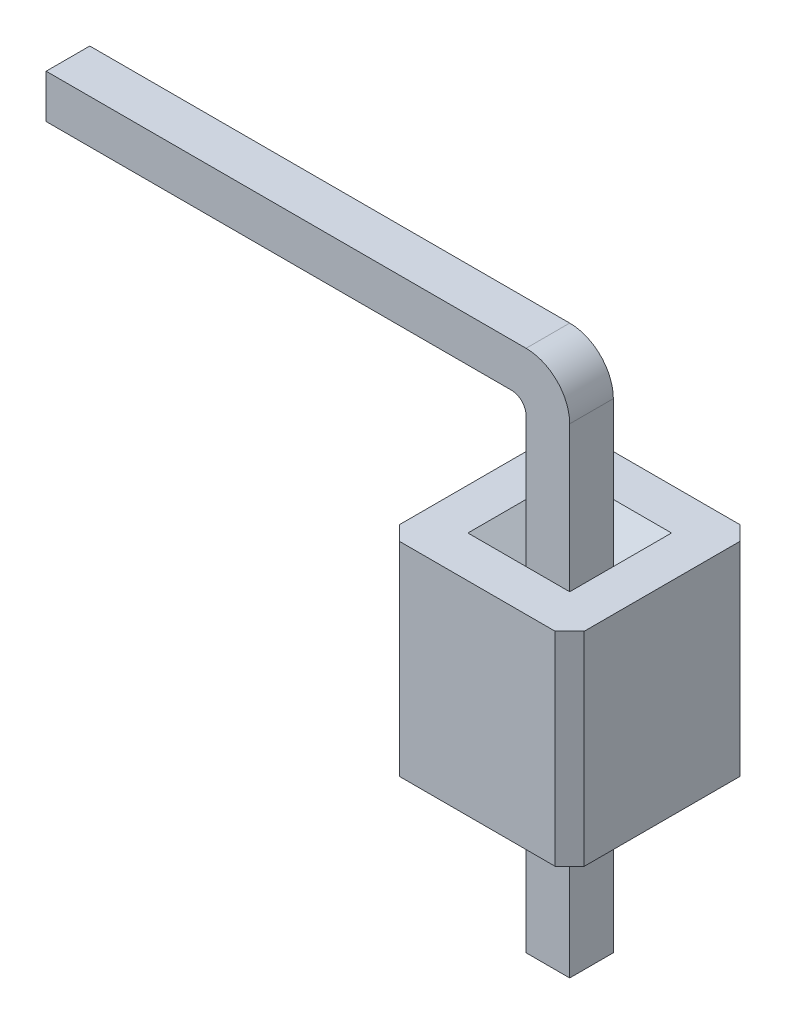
ISO-10303-21;
HEADER;
FILE_DESCRIPTION(('STEP AP214'),'2;1');
FILE_NAME('part.step','',(''),(''),'','','');
FILE_SCHEMA(('AUTOMOTIVE_DESIGN { 1 0 10303 214 1 1 1 1 }'));
ENDSEC;
DATA;
#1=APPLICATION_CONTEXT('core data for automotive mechanical design processes');
#2=APPLICATION_PROTOCOL_DEFINITION('international standard','automotive_design',2000,#1);
#3=PRODUCT_CONTEXT('',#1,'mechanical');
#4=PRODUCT('Part','Part','',(#3));
#5=PRODUCT_RELATED_PRODUCT_CATEGORY('part','',(#4));
#6=PRODUCT_DEFINITION_FORMATION('','',#4);
#7=PRODUCT_DEFINITION_CONTEXT('part definition',#1,'design');
#8=PRODUCT_DEFINITION('design','',#6,#7);
#9=PRODUCT_DEFINITION_SHAPE('','',#8);
#10=(LENGTH_UNIT() NAMED_UNIT(*) SI_UNIT(.MILLI.,.METRE.));
#11=(NAMED_UNIT(*) PLANE_ANGLE_UNIT() SI_UNIT($,.RADIAN.));
#12=(NAMED_UNIT(*) SI_UNIT($,.STERADIAN.) SOLID_ANGLE_UNIT());
#13=UNCERTAINTY_MEASURE_WITH_UNIT(LENGTH_MEASURE(1.E-05),#10,'distance_accuracy_value','');
#14=(GEOMETRIC_REPRESENTATION_CONTEXT(3) GLOBAL_UNCERTAINTY_ASSIGNED_CONTEXT((#13)) GLOBAL_UNIT_ASSIGNED_CONTEXT((#10,
#11,#12)) REPRESENTATION_CONTEXT('',''));
#15=CARTESIAN_POINT('',(0.,0.,0.));
#16=DIRECTION('',(0.,0.,1.));
#17=DIRECTION('',(1.,0.,0.));
#18=AXIS2_PLACEMENT_3D('',#15,#16,#17);
#19=CARTESIAN_POINT('',(-0.3,-2.2,0.3));
#20=DIRECTION('',(1.,0.,0.));
#21=DIRECTION('',(0.,0.,-1.));
#22=AXIS2_PLACEMENT_3D('',#19,#20,#21);
#23=PLANE('',#22);
#24=DIRECTION('',(0.,1.,0.));
#25=VECTOR('',#24,1.);
#26=CARTESIAN_POINT('',(-0.3,-2.2,0.3));
#27=LINE('',#26,#25);
#28=CARTESIAN_POINT('',(-0.3,2.4,0.3));
#29=VERTEX_POINT('',#28);
#30=CARTESIAN_POINT('',(-0.3,4.2,0.3));
#31=VERTEX_POINT('',#30);
#32=EDGE_CURVE('E223',#29,#31,#27,.T.);
#33=ORIENTED_EDGE('',*,*,#32,.T.);
#34=DIRECTION('',(0.,0.,1.));
#35=VECTOR('',#34,1.);
#36=CARTESIAN_POINT('',(-0.3,4.2,-0.3));
#37=LINE('',#36,#35);
#38=CARTESIAN_POINT('',(-0.3,4.2,-0.3));
#39=VERTEX_POINT('',#38);
#40=EDGE_CURVE('E47',#31,#39,#37,.F.);
#41=ORIENTED_EDGE('',*,*,#40,.T.);
#42=DIRECTION('',(0.,1.,0.));
#43=VECTOR('',#42,1.);
#44=CARTESIAN_POINT('',(-0.3,-2.2,-0.3));
#45=LINE('',#44,#43);
#46=CARTESIAN_POINT('',(-0.3,2.4,-0.3));
#47=VERTEX_POINT('',#46);
#48=EDGE_CURVE('E220',#47,#39,#45,.T.);
#49=ORIENTED_EDGE('',*,*,#48,.F.);
#50=DIRECTION('',(0.,0.,1.));
#51=VECTOR('',#50,1.);
#52=CARTESIAN_POINT('',(-0.3,2.4,0.3));
#53=LINE('',#52,#51);
#54=EDGE_CURVE('E327',#47,#29,#53,.T.);
#55=ORIENTED_EDGE('',*,*,#54,.T.);
#56=EDGE_LOOP('',(#33,#41,#49,#55));
#57=FACE_BOUND('',#56,.T.);
#58=ADVANCED_FACE('F26',(#57),#23,.F.);
#59=CARTESIAN_POINT('',(2.34,2.8,0.));
#60=DIRECTION('',(0.,-1.,0.));
#61=DIRECTION('',(0.,0.,-1.));
#62=AXIS2_PLACEMENT_3D('',#59,#60,#61);
#63=PLANE('',#62);
#64=DIRECTION('',(1.,0.,0.));
#65=VECTOR('',#64,1.);
#66=CARTESIAN_POINT('',(0.299999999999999,2.8,-0.700000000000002));
#67=LINE('',#66,#65);
#68=CARTESIAN_POINT('',(-0.700000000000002,2.8,-0.700000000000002));
#69=VERTEX_POINT('',#68);
#70=CARTESIAN_POINT('',(0.700000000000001,2.8,-0.700000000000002));
#71=VERTEX_POINT('',#70);
#72=EDGE_CURVE('E315',#69,#71,#67,.T.);
#73=ORIENTED_EDGE('',*,*,#72,.T.);
#74=DIRECTION('',(0.,0.,1.));
#75=VECTOR('',#74,1.);
#76=CARTESIAN_POINT('',(0.700000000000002,2.8,0.3));
#77=LINE('',#76,#75);
#78=CARTESIAN_POINT('',(0.700000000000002,2.8,0.700000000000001));
#79=VERTEX_POINT('',#78);
#80=EDGE_CURVE('E321',#71,#79,#77,.T.);
#81=ORIENTED_EDGE('',*,*,#80,.T.);
#82=DIRECTION('',(-1.,0.,0.));
#83=VECTOR('',#82,1.);
#84=CARTESIAN_POINT('',(-0.3,2.8,0.700000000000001));
#85=LINE('',#84,#83);
#86=CARTESIAN_POINT('',(-0.700000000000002,2.8,0.700000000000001));
#87=VERTEX_POINT('',#86);
#88=EDGE_CURVE('E319',#79,#87,#85,.T.);
#89=ORIENTED_EDGE('',*,*,#88,.T.);
#90=DIRECTION('',(0.,0.,-1.));
#91=VECTOR('',#90,1.);
#92=CARTESIAN_POINT('',(-0.700000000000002,2.8,-0.3));
#93=LINE('',#92,#91);
#94=EDGE_CURVE('E317',#87,#69,#93,.T.);
#95=ORIENTED_EDGE('',*,*,#94,.T.);
#96=EDGE_LOOP('',(#73,#81,#89,#95));
#97=FACE_BOUND('',#96,.T.);
#98=DIRECTION('',(-0.707106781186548,0.,-0.707106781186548));
#99=VECTOR('',#98,1.);
#100=CARTESIAN_POINT('',(1.07,2.8,-1.27));
#101=LINE('',#100,#99);
#102=CARTESIAN_POINT('',(1.27,2.8,-1.07));
#103=VERTEX_POINT('',#102);
#104=CARTESIAN_POINT('',(1.07,2.8,-1.27));
#105=VERTEX_POINT('',#104);
#106=EDGE_CURVE('E271',#103,#105,#101,.T.);
#107=ORIENTED_EDGE('',*,*,#106,.T.);
#108=DIRECTION('',(-1.,0.,0.));
#109=VECTOR('',#108,1.);
#110=CARTESIAN_POINT('',(-1.07,2.8,-1.27));
#111=LINE('',#110,#109);
#112=CARTESIAN_POINT('',(-1.07,2.8,-1.27));
#113=VERTEX_POINT('',#112);
#114=EDGE_CURVE('E274',#105,#113,#111,.T.);
#115=ORIENTED_EDGE('',*,*,#114,.T.);
#116=DIRECTION('',(-0.707106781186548,0.,0.707106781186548));
#117=VECTOR('',#116,1.);
#118=CARTESIAN_POINT('',(-1.07,2.8,-1.27));
#119=LINE('',#118,#117);
#120=CARTESIAN_POINT('',(-1.27,2.8,-1.07));
#121=VERTEX_POINT('',#120);
#122=EDGE_CURVE('E276',#113,#121,#119,.T.);
#123=ORIENTED_EDGE('',*,*,#122,.T.);
#124=DIRECTION('',(0.,0.,1.));
#125=VECTOR('',#124,1.);
#126=CARTESIAN_POINT('',(-1.27,2.8,-1.07));
#127=LINE('',#126,#125);
#128=CARTESIAN_POINT('',(-1.27,2.8,1.07));
#129=VERTEX_POINT('',#128);
#130=EDGE_CURVE('E278',#121,#129,#127,.T.);
#131=ORIENTED_EDGE('',*,*,#130,.T.);
#132=DIRECTION('',(0.707106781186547,0.,0.707106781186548));
#133=VECTOR('',#132,1.);
#134=CARTESIAN_POINT('',(-1.27,2.8,1.07));
#135=LINE('',#134,#133);
#136=CARTESIAN_POINT('',(-1.07,2.8,1.27));
#137=VERTEX_POINT('',#136);
#138=EDGE_CURVE('E280',#129,#137,#135,.T.);
#139=ORIENTED_EDGE('',*,*,#138,.T.);
#140=DIRECTION('',(1.,0.,0.));
#141=VECTOR('',#140,1.);
#142=CARTESIAN_POINT('',(-1.07,2.8,1.27));
#143=LINE('',#142,#141);
#144=CARTESIAN_POINT('',(1.07,2.8,1.27));
#145=VERTEX_POINT('',#144);
#146=EDGE_CURVE('E282',#137,#145,#143,.T.);
#147=ORIENTED_EDGE('',*,*,#146,.T.);
#148=DIRECTION('',(0.707106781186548,0.,-0.707106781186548));
#149=VECTOR('',#148,1.);
#150=CARTESIAN_POINT('',(1.27,2.8,1.07));
#151=LINE('',#150,#149);
#152=CARTESIAN_POINT('',(1.27,2.8,1.07));
#153=VERTEX_POINT('',#152);
#154=EDGE_CURVE('E284',#145,#153,#151,.T.);
#155=ORIENTED_EDGE('',*,*,#154,.T.);
#156=DIRECTION('',(0.,0.,-1.));
#157=VECTOR('',#156,1.);
#158=CARTESIAN_POINT('',(1.27,2.8,-1.07));
#159=LINE('',#158,#157);
#160=EDGE_CURVE('E286',#153,#103,#159,.T.);
#161=ORIENTED_EDGE('',*,*,#160,.T.);
#162=EDGE_LOOP('',(#107,#115,#123,#131,#139,#147,#155,#161));
#163=FACE_BOUND('',#162,.T.);
#164=ADVANCED_FACE('F383',(#97,#163),#63,.F.);
#165=CARTESIAN_POINT('',(2.34,0.,0.));
#166=DIRECTION('',(0.,-1.,0.));
#167=DIRECTION('',(0.,0.,-1.));
#168=AXIS2_PLACEMENT_3D('',#165,#166,#167);
#169=PLANE('',#168);
#170=DIRECTION('',(-0.707106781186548,0.,-0.707106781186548));
#171=VECTOR('',#170,1.);
#172=CARTESIAN_POINT('',(1.07,0.,-1.27));
#173=LINE('',#172,#171);
#174=CARTESIAN_POINT('',(1.27,0.,-1.07));
#175=VERTEX_POINT('',#174);
#176=CARTESIAN_POINT('',(1.07,0.,-1.27));
#177=VERTEX_POINT('',#176);
#178=EDGE_CURVE('E254',#175,#177,#173,.T.);
#179=ORIENTED_EDGE('',*,*,#178,.F.);
#180=DIRECTION('',(0.,0.,-1.));
#181=VECTOR('',#180,1.);
#182=CARTESIAN_POINT('',(1.27,0.,-1.07));
#183=LINE('',#182,#181);
#184=CARTESIAN_POINT('',(1.27,0.,1.07));
#185=VERTEX_POINT('',#184);
#186=EDGE_CURVE('E269',#185,#175,#183,.T.);
#187=ORIENTED_EDGE('',*,*,#186,.F.);
#188=DIRECTION('',(0.707106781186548,0.,-0.707106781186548));
#189=VECTOR('',#188,1.);
#190=CARTESIAN_POINT('',(1.27,0.,1.07));
#191=LINE('',#190,#189);
#192=CARTESIAN_POINT('',(1.07,0.,1.27));
#193=VERTEX_POINT('',#192);
#194=EDGE_CURVE('E267',#193,#185,#191,.T.);
#195=ORIENTED_EDGE('',*,*,#194,.F.);
#196=DIRECTION('',(1.,0.,0.));
#197=VECTOR('',#196,1.);
#198=CARTESIAN_POINT('',(-1.07,0.,1.27));
#199=LINE('',#198,#197);
#200=CARTESIAN_POINT('',(-1.07,0.,1.27));
#201=VERTEX_POINT('',#200);
#202=EDGE_CURVE('E265',#201,#193,#199,.T.);
#203=ORIENTED_EDGE('',*,*,#202,.F.);
#204=DIRECTION('',(0.707106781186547,0.,0.707106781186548));
#205=VECTOR('',#204,1.);
#206=CARTESIAN_POINT('',(-1.27,0.,1.07));
#207=LINE('',#206,#205);
#208=CARTESIAN_POINT('',(-1.27,0.,1.07));
#209=VERTEX_POINT('',#208);
#210=EDGE_CURVE('E263',#209,#201,#207,.T.);
#211=ORIENTED_EDGE('',*,*,#210,.F.);
#212=DIRECTION('',(0.,0.,1.));
#213=VECTOR('',#212,1.);
#214=CARTESIAN_POINT('',(-1.27,0.,-1.07));
#215=LINE('',#214,#213);
#216=CARTESIAN_POINT('',(-1.27,0.,-1.07));
#217=VERTEX_POINT('',#216);
#218=EDGE_CURVE('E261',#217,#209,#215,.T.);
#219=ORIENTED_EDGE('',*,*,#218,.F.);
#220=DIRECTION('',(-0.707106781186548,0.,0.707106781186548));
#221=VECTOR('',#220,1.);
#222=CARTESIAN_POINT('',(-1.07,0.,-1.27));
#223=LINE('',#222,#221);
#224=CARTESIAN_POINT('',(-1.07,0.,-1.27));
#225=VERTEX_POINT('',#224);
#226=EDGE_CURVE('E259',#225,#217,#223,.T.);
#227=ORIENTED_EDGE('',*,*,#226,.F.);
#228=DIRECTION('',(-1.,0.,0.));
#229=VECTOR('',#228,1.);
#230=CARTESIAN_POINT('',(-1.07,0.,-1.27));
#231=LINE('',#230,#229);
#232=EDGE_CURVE('E257',#177,#225,#231,.T.);
#233=ORIENTED_EDGE('',*,*,#232,.F.);
#234=EDGE_LOOP('',(#179,#187,#195,#203,#211,#219,#227,#233));
#235=FACE_BOUND('',#234,.T.);
#236=DIRECTION('',(-1.,0.,0.));
#237=VECTOR('',#236,1.);
#238=CARTESIAN_POINT('',(-0.3,0.,-0.3));
#239=LINE('',#238,#237);
#240=CARTESIAN_POINT('',(0.3,0.,-0.3));
#241=VERTEX_POINT('',#240);
#242=CARTESIAN_POINT('',(-0.3,0.,-0.3));
#243=VERTEX_POINT('',#242);
#244=EDGE_CURVE('E251',#241,#243,#239,.T.);
#245=ORIENTED_EDGE('',*,*,#244,.T.);
#246=DIRECTION('',(0.,0.,1.));
#247=VECTOR('',#246,1.);
#248=CARTESIAN_POINT('',(-0.3,0.,-0.3));
#249=LINE('',#248,#247);
#250=CARTESIAN_POINT('',(-0.3,0.,0.3));
#251=VERTEX_POINT('',#250);
#252=EDGE_CURVE('E242',#243,#251,#249,.T.);
#253=ORIENTED_EDGE('',*,*,#252,.T.);
#254=DIRECTION('',(1.,0.,0.));
#255=VECTOR('',#254,1.);
#256=CARTESIAN_POINT('',(-0.3,0.,0.3));
#257=LINE('',#256,#255);
#258=CARTESIAN_POINT('',(0.3,0.,0.3));
#259=VERTEX_POINT('',#258);
#260=EDGE_CURVE('E245',#251,#259,#257,.T.);
#261=ORIENTED_EDGE('',*,*,#260,.T.);
#262=DIRECTION('',(0.,0.,-1.));
#263=VECTOR('',#262,1.);
#264=CARTESIAN_POINT('',(0.3,0.,-0.3));
#265=LINE('',#264,#263);
#266=EDGE_CURVE('E248',#259,#241,#265,.T.);
#267=ORIENTED_EDGE('',*,*,#266,.T.);
#268=EDGE_LOOP('',(#245,#253,#261,#267));
#269=FACE_BOUND('',#268,.T.);
#270=ADVANCED_FACE('F390',(#235,#269),#169,.T.);
#271=CARTESIAN_POINT('',(1.07,2.8,-1.27));
#272=DIRECTION('',(-0.707106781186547,0.,0.707106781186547));
#273=DIRECTION('',(0.707106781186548,0.,0.707106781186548));
#274=AXIS2_PLACEMENT_3D('',#271,#272,#273);
#275=PLANE('',#274);
#276=ORIENTED_EDGE('',*,*,#178,.T.);
#277=DIRECTION('',(0.,-1.,0.));
#278=VECTOR('',#277,1.);
#279=CARTESIAN_POINT('',(1.07,2.8,-1.27));
#280=LINE('',#279,#278);
#281=EDGE_CURVE('E309',#105,#177,#280,.T.);
#282=ORIENTED_EDGE('',*,*,#281,.F.);
#283=ORIENTED_EDGE('',*,*,#106,.F.);
#284=DIRECTION('',(0.,-1.,0.));
#285=VECTOR('',#284,1.);
#286=CARTESIAN_POINT('',(1.27,2.8,-1.07));
#287=LINE('',#286,#285);
#288=EDGE_CURVE('E288',#103,#175,#287,.T.);
#289=ORIENTED_EDGE('',*,*,#288,.T.);
#290=EDGE_LOOP('',(#276,#282,#283,#289));
#291=FACE_BOUND('',#290,.T.);
#292=ADVANCED_FACE('F28',(#291),#275,.F.);
#293=CARTESIAN_POINT('',(-1.07,2.8,-1.27));
#294=DIRECTION('',(0.,0.,1.));
#295=DIRECTION('',(1.,0.,0.));
#296=AXIS2_PLACEMENT_3D('',#293,#294,#295);
#297=PLANE('',#296);
#298=ORIENTED_EDGE('',*,*,#232,.T.);
#299=DIRECTION('',(0.,-1.,0.));
#300=VECTOR('',#299,1.);
#301=CARTESIAN_POINT('',(-1.07,2.8,-1.27));
#302=LINE('',#301,#300);
#303=EDGE_CURVE('E306',#113,#225,#302,.T.);
#304=ORIENTED_EDGE('',*,*,#303,.F.);
#305=ORIENTED_EDGE('',*,*,#114,.F.);
#306=ORIENTED_EDGE('',*,*,#281,.T.);
#307=EDGE_LOOP('',(#298,#304,#305,#306));
#308=FACE_BOUND('',#307,.T.);
#309=ADVANCED_FACE('F561',(#308),#297,.F.);
#310=CARTESIAN_POINT('',(-1.07,2.8,-1.27));
#311=DIRECTION('',(0.707106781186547,0.,0.707106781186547));
#312=DIRECTION('',(0.707106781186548,0.,-0.707106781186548));
#313=AXIS2_PLACEMENT_3D('',#310,#311,#312);
#314=PLANE('',#313);
#315=ORIENTED_EDGE('',*,*,#226,.T.);
#316=DIRECTION('',(0.,-1.,0.));
#317=VECTOR('',#316,1.);
#318=CARTESIAN_POINT('',(-1.27,2.8,-1.07));
#319=LINE('',#318,#317);
#320=EDGE_CURVE('E303',#121,#217,#319,.T.);
#321=ORIENTED_EDGE('',*,*,#320,.F.);
#322=ORIENTED_EDGE('',*,*,#122,.F.);
#323=ORIENTED_EDGE('',*,*,#303,.T.);
#324=EDGE_LOOP('',(#315,#321,#322,#323));
#325=FACE_BOUND('',#324,.T.);
#326=ADVANCED_FACE('F553',(#325),#314,.F.);
#327=CARTESIAN_POINT('',(-1.27,2.8,-1.07));
#328=DIRECTION('',(1.,0.,0.));
#329=DIRECTION('',(0.,0.,-1.));
#330=AXIS2_PLACEMENT_3D('',#327,#328,#329);
#331=PLANE('',#330);
#332=ORIENTED_EDGE('',*,*,#218,.T.);
#333=DIRECTION('',(0.,-1.,0.));
#334=VECTOR('',#333,1.);
#335=CARTESIAN_POINT('',(-1.27,2.8,1.07));
#336=LINE('',#335,#334);
#337=EDGE_CURVE('E300',#129,#209,#336,.T.);
#338=ORIENTED_EDGE('',*,*,#337,.F.);
#339=ORIENTED_EDGE('',*,*,#130,.F.);
#340=ORIENTED_EDGE('',*,*,#320,.T.);
#341=EDGE_LOOP('',(#332,#338,#339,#340));
#342=FACE_BOUND('',#341,.T.);
#343=ADVANCED_FACE('F545',(#342),#331,.F.);
#344=CARTESIAN_POINT('',(-1.27,2.8,1.07));
#345=DIRECTION('',(0.707106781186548,0.,-0.707106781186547));
#346=DIRECTION('',(-0.707106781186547,0.,-0.707106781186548));
#347=AXIS2_PLACEMENT_3D('',#344,#345,#346);
#348=PLANE('',#347);
#349=ORIENTED_EDGE('',*,*,#210,.T.);
#350=DIRECTION('',(0.,-1.,0.));
#351=VECTOR('',#350,1.);
#352=CARTESIAN_POINT('',(-1.07,2.8,1.27));
#353=LINE('',#352,#351);
#354=EDGE_CURVE('E297',#137,#201,#353,.T.);
#355=ORIENTED_EDGE('',*,*,#354,.F.);
#356=ORIENTED_EDGE('',*,*,#138,.F.);
#357=ORIENTED_EDGE('',*,*,#337,.T.);
#358=EDGE_LOOP('',(#349,#355,#356,#357));
#359=FACE_BOUND('',#358,.T.);
#360=ADVANCED_FACE('F537',(#359),#348,.F.);
#361=CARTESIAN_POINT('',(-1.07,2.8,1.27));
#362=DIRECTION('',(0.,0.,-1.));
#363=DIRECTION('',(-1.,0.,0.));
#364=AXIS2_PLACEMENT_3D('',#361,#362,#363);
#365=PLANE('',#364);
#366=ORIENTED_EDGE('',*,*,#202,.T.);
#367=DIRECTION('',(0.,-1.,0.));
#368=VECTOR('',#367,1.);
#369=CARTESIAN_POINT('',(1.07,2.8,1.27));
#370=LINE('',#369,#368);
#371=EDGE_CURVE('E294',#145,#193,#370,.T.);
#372=ORIENTED_EDGE('',*,*,#371,.F.);
#373=ORIENTED_EDGE('',*,*,#146,.F.);
#374=ORIENTED_EDGE('',*,*,#354,.T.);
#375=EDGE_LOOP('',(#366,#372,#373,#374));
#376=FACE_BOUND('',#375,.T.);
#377=ADVANCED_FACE('F529',(#376),#365,.F.);
#378=CARTESIAN_POINT('',(1.27,2.8,1.07));
#379=DIRECTION('',(-0.707106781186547,0.,-0.707106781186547));
#380=DIRECTION('',(-0.707106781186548,0.,0.707106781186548));
#381=AXIS2_PLACEMENT_3D('',#378,#379,#380);
#382=PLANE('',#381);
#383=ORIENTED_EDGE('',*,*,#194,.T.);
#384=DIRECTION('',(0.,-1.,0.));
#385=VECTOR('',#384,1.);
#386=CARTESIAN_POINT('',(1.27,2.8,1.07));
#387=LINE('',#386,#385);
#388=EDGE_CURVE('E291',#153,#185,#387,.T.);
#389=ORIENTED_EDGE('',*,*,#388,.F.);
#390=ORIENTED_EDGE('',*,*,#154,.F.);
#391=ORIENTED_EDGE('',*,*,#371,.T.);
#392=EDGE_LOOP('',(#383,#389,#390,#391));
#393=FACE_BOUND('',#392,.T.);
#394=ADVANCED_FACE('F521',(#393),#382,.F.);
#395=CARTESIAN_POINT('',(1.27,2.8,-1.07));
#396=DIRECTION('',(-1.,0.,0.));
#397=DIRECTION('',(0.,0.,1.));
#398=AXIS2_PLACEMENT_3D('',#395,#396,#397);
#399=PLANE('',#398);
#400=ORIENTED_EDGE('',*,*,#186,.T.);
#401=ORIENTED_EDGE('',*,*,#288,.F.);
#402=ORIENTED_EDGE('',*,*,#160,.F.);
#403=ORIENTED_EDGE('',*,*,#388,.T.);
#404=EDGE_LOOP('',(#400,#401,#402,#403));
#405=FACE_BOUND('',#404,.T.);
#406=ADVANCED_FACE('F513',(#405),#399,.F.);
#407=CARTESIAN_POINT('',(-0.3,2.4,-0.3));
#408=DIRECTION('',(0.707106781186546,0.707106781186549,0.));
#409=DIRECTION('',(-0.707106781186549,0.707106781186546,0.));
#410=AXIS2_PLACEMENT_3D('',#407,#408,#409);
#411=PLANE('',#410);
#412=DIRECTION('',(0.577350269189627,-0.577350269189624,0.577350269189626));
#413=VECTOR('',#412,1.);
#414=CARTESIAN_POINT('',(-0.3,2.4,-0.3));
#415=LINE('',#414,#413);
#416=EDGE_CURVE('E236',#69,#47,#415,.T.);
#417=ORIENTED_EDGE('',*,*,#416,.F.);
#418=ORIENTED_EDGE('',*,*,#94,.F.);
#419=DIRECTION('',(0.577350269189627,-0.577350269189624,-0.577350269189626));
#420=VECTOR('',#419,1.);
#421=CARTESIAN_POINT('',(-0.3,2.4,0.3));
#422=LINE('',#421,#420);
#423=EDGE_CURVE('E239',#29,#87,#422,.F.);
#424=ORIENTED_EDGE('',*,*,#423,.F.);
#425=ORIENTED_EDGE('',*,*,#54,.F.);
#426=EDGE_LOOP('',(#417,#418,#424,#425));
#427=FACE_BOUND('',#426,.T.);
#428=ADVANCED_FACE('F368',(#427),#411,.T.);
#429=CARTESIAN_POINT('',(-0.3,2.4,0.3));
#430=DIRECTION('',(0.,0.707106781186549,-0.707106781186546));
#431=DIRECTION('',(0.,0.707106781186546,0.707106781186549));
#432=AXIS2_PLACEMENT_3D('',#429,#430,#431);
#433=PLANE('',#432);
#434=ORIENTED_EDGE('',*,*,#423,.T.);
#435=ORIENTED_EDGE('',*,*,#88,.F.);
#436=DIRECTION('',(-0.577350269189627,-0.577350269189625,-0.577350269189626));
#437=VECTOR('',#436,1.);
#438=CARTESIAN_POINT('',(0.0999999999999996,2.2,0.0999999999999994));
#439=LINE('',#438,#437);
#440=CARTESIAN_POINT('',(0.3,2.4,0.3));
#441=VERTEX_POINT('',#440);
#442=EDGE_CURVE('E234',#441,#79,#439,.F.);
#443=ORIENTED_EDGE('',*,*,#442,.F.);
#444=DIRECTION('',(1.,0.,0.));
#445=VECTOR('',#444,1.);
#446=CARTESIAN_POINT('',(0.3,2.4,0.3));
#447=LINE('',#446,#445);
#448=EDGE_CURVE('E324',#29,#441,#447,.T.);
#449=ORIENTED_EDGE('',*,*,#448,.F.);
#450=EDGE_LOOP('',(#434,#435,#443,#449));
#451=FACE_BOUND('',#450,.T.);
#452=ADVANCED_FACE('F363',(#451),#433,.T.);
#453=CARTESIAN_POINT('',(-0.3,2.4,-0.3));
#454=DIRECTION('',(0.,0.707106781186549,0.707106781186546));
#455=DIRECTION('',(0.,-0.707106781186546,0.707106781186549));
#456=AXIS2_PLACEMENT_3D('',#453,#454,#455);
#457=PLANE('',#456);
#458=ORIENTED_EDGE('',*,*,#416,.T.);
#459=DIRECTION('',(-1.,0.,0.));
#460=VECTOR('',#459,1.);
#461=CARTESIAN_POINT('',(-0.3,2.4,-0.3));
#462=LINE('',#461,#460);
#463=CARTESIAN_POINT('',(0.3,2.4,-0.3));
#464=VERTEX_POINT('',#463);
#465=EDGE_CURVE('E330',#464,#47,#462,.T.);
#466=ORIENTED_EDGE('',*,*,#465,.F.);
#467=DIRECTION('',(0.577350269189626,0.577350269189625,-0.577350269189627));
#468=VECTOR('',#467,1.);
#469=CARTESIAN_POINT('',(0.3,2.4,-0.3));
#470=LINE('',#469,#468);
#471=EDGE_CURVE('E231',#71,#464,#470,.F.);
#472=ORIENTED_EDGE('',*,*,#471,.F.);
#473=ORIENTED_EDGE('',*,*,#72,.F.);
#474=EDGE_LOOP('',(#458,#466,#472,#473));
#475=FACE_BOUND('',#474,.T.);
#476=ADVANCED_FACE('F372',(#475),#457,.T.);
#477=CARTESIAN_POINT('',(0.3,2.4,-0.3));
#478=DIRECTION('',(-0.707106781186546,0.707106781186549,0.));
#479=DIRECTION('',(-0.707106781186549,-0.707106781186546,0.));
#480=AXIS2_PLACEMENT_3D('',#477,#478,#479);
#481=PLANE('',#480);
#482=ORIENTED_EDGE('',*,*,#442,.T.);
#483=ORIENTED_EDGE('',*,*,#80,.F.);
#484=ORIENTED_EDGE('',*,*,#471,.T.);
#485=DIRECTION('',(0.,0.,-1.));
#486=VECTOR('',#485,1.);
#487=CARTESIAN_POINT('',(0.3,2.4,-0.3));
#488=LINE('',#487,#486);
#489=EDGE_CURVE('E312',#441,#464,#488,.T.);
#490=ORIENTED_EDGE('',*,*,#489,.F.);
#491=EDGE_LOOP('',(#482,#483,#484,#490));
#492=FACE_BOUND('',#491,.T.);
#493=ADVANCED_FACE('F451',(#492),#481,.T.);
#494=CARTESIAN_POINT('',(0.3,5.,-0.3));
#495=DIRECTION('',(0.,1.,0.));
#496=DIRECTION('',(0.,0.,1.));
#497=AXIS2_PLACEMENT_3D('',#494,#495,#496);
#498=PLANE('',#497);
#499=DIRECTION('',(-1.,0.,0.));
#500=VECTOR('',#499,1.);
#501=CARTESIAN_POINT('',(0.3,5.,0.3));
#502=LINE('',#501,#500);
#503=CARTESIAN_POINT('',(-0.3,5.,0.3));
#504=VERTEX_POINT('',#503);
#505=CARTESIAN_POINT('',(-6.9,5.,0.3));
#506=VERTEX_POINT('',#505);
#507=EDGE_CURVE('E199',#504,#506,#502,.T.);
#508=ORIENTED_EDGE('',*,*,#507,.F.);
#509=DIRECTION('',(0.,0.,1.));
#510=VECTOR('',#509,1.);
#511=CARTESIAN_POINT('',(-0.3,5.,-0.3));
#512=LINE('',#511,#510);
#513=CARTESIAN_POINT('',(-0.3,5.,-0.3));
#514=VERTEX_POINT('',#513);
#515=EDGE_CURVE('E338',#504,#514,#512,.F.);
#516=ORIENTED_EDGE('',*,*,#515,.T.);
#517=DIRECTION('',(1.,0.,0.));
#518=VECTOR('',#517,1.);
#519=CARTESIAN_POINT('',(0.3,5.,-0.3));
#520=LINE('',#519,#518);
#521=CARTESIAN_POINT('',(-6.9,5.,-0.3));
#522=VERTEX_POINT('',#521);
#523=EDGE_CURVE('E201',#522,#514,#520,.T.);
#524=ORIENTED_EDGE('',*,*,#523,.F.);
#525=DIRECTION('',(0.,0.,-1.));
#526=VECTOR('',#525,1.);
#527=CARTESIAN_POINT('',(-6.9,5.,-0.3));
#528=LINE('',#527,#526);
#529=EDGE_CURVE('E193',#506,#522,#528,.T.);
#530=ORIENTED_EDGE('',*,*,#529,.F.);
#531=EDGE_LOOP('',(#508,#516,#524,#530));
#532=FACE_BOUND('',#531,.T.);
#533=ADVANCED_FACE('F350',(#532),#498,.T.);
#534=CARTESIAN_POINT('',(0.3,-2.2,0.3));
#535=DIRECTION('',(-1.,0.,0.));
#536=DIRECTION('',(0.,0.,1.));
#537=AXIS2_PLACEMENT_3D('',#534,#535,#536);
#538=PLANE('',#537);
#539=DIRECTION('',(0.,1.,0.));
#540=VECTOR('',#539,1.);
#541=CARTESIAN_POINT('',(0.3,-2.2,-0.3));
#542=LINE('',#541,#540);
#543=CARTESIAN_POINT('',(0.3,4.4,-0.3));
#544=VERTEX_POINT('',#543);
#545=EDGE_CURVE('E216',#464,#544,#542,.T.);
#546=ORIENTED_EDGE('',*,*,#545,.T.);
#547=DIRECTION('',(0.,0.,1.));
#548=VECTOR('',#547,1.);
#549=CARTESIAN_POINT('',(0.3,4.4,0.3));
#550=LINE('',#549,#548);
#551=CARTESIAN_POINT('',(0.3,4.4,0.3));
#552=VERTEX_POINT('',#551);
#553=EDGE_CURVE('E333',#544,#552,#550,.T.);
#554=ORIENTED_EDGE('',*,*,#553,.T.);
#555=DIRECTION('',(0.,1.,0.));
#556=VECTOR('',#555,1.);
#557=CARTESIAN_POINT('',(0.3,-2.2,0.3));
#558=LINE('',#557,#556);
#559=EDGE_CURVE('E227',#441,#552,#558,.T.);
#560=ORIENTED_EDGE('',*,*,#559,.F.);
#561=ORIENTED_EDGE('',*,*,#489,.T.);
#562=EDGE_LOOP('',(#546,#554,#560,#561));
#563=FACE_BOUND('',#562,.T.);
#564=ADVANCED_FACE('F360',(#563),#538,.F.);
#565=CARTESIAN_POINT('',(0.3,-2.2,-0.3));
#566=DIRECTION('',(0.,0.,1.));
#567=DIRECTION('',(1.,0.,0.));
#568=AXIS2_PLACEMENT_3D('',#565,#566,#567);
#569=PLANE('',#568);
#570=ORIENTED_EDGE('',*,*,#523,.T.);
#571=CARTESIAN_POINT('',(-0.3,4.4,-0.3));
#572=DIRECTION('',(0.,0.,1.));
#573=DIRECTION('',(1.,0.,0.));
#574=AXIS2_PLACEMENT_3D('',#571,#572,#573);
#575=CIRCLE('',#574,0.6);
#576=EDGE_CURVE('E340',#514,#544,#575,.F.);
#577=ORIENTED_EDGE('',*,*,#576,.T.);
#578=ORIENTED_EDGE('',*,*,#545,.F.);
#579=ORIENTED_EDGE('',*,*,#465,.T.);
#580=ORIENTED_EDGE('',*,*,#48,.T.);
#581=CARTESIAN_POINT('',(-0.5,4.2,-0.3));
#582=DIRECTION('',(0.,0.,1.));
#583=DIRECTION('',(1.,0.,0.));
#584=AXIS2_PLACEMENT_3D('',#581,#582,#583);
#585=CIRCLE('',#584,0.2);
#586=CARTESIAN_POINT('',(-0.5,4.4,-0.3));
#587=VERTEX_POINT('',#586);
#588=EDGE_CURVE('E11',#39,#587,#585,.T.);
#589=ORIENTED_EDGE('',*,*,#588,.T.);
#590=DIRECTION('',(1.,0.,0.));
#591=VECTOR('',#590,1.);
#592=CARTESIAN_POINT('',(-6.9,4.4,-0.3));
#593=LINE('',#592,#591);
#594=CARTESIAN_POINT('',(-6.9,4.4,-0.3));
#595=VERTEX_POINT('',#594);
#596=EDGE_CURVE('E180',#595,#587,#593,.T.);
#597=ORIENTED_EDGE('',*,*,#596,.F.);
#598=DIRECTION('',(0.,-1.,0.));
#599=VECTOR('',#598,1.);
#600=CARTESIAN_POINT('',(-6.9,5.,-0.3));
#601=LINE('',#600,#599);
#602=EDGE_CURVE('E187',#522,#595,#601,.T.);
#603=ORIENTED_EDGE('',*,*,#602,.F.);
#604=EDGE_LOOP('',(#570,#577,#578,#579,#580,#589,#597,#603));
#605=FACE_BOUND('',#604,.T.);
#606=ADVANCED_FACE('F197',(#605),#569,.F.);
#607=CARTESIAN_POINT('',(0.3,-2.2,0.3));
#608=DIRECTION('',(0.,0.,-1.));
#609=DIRECTION('',(-1.,0.,0.));
#610=AXIS2_PLACEMENT_3D('',#607,#608,#609);
#611=PLANE('',#610);
#612=ORIENTED_EDGE('',*,*,#559,.T.);
#613=CARTESIAN_POINT('',(-0.3,4.4,0.3));
#614=DIRECTION('',(0.,0.,-1.));
#615=DIRECTION('',(-1.,0.,0.));
#616=AXIS2_PLACEMENT_3D('',#613,#614,#615);
#617=CIRCLE('',#616,0.6);
#618=EDGE_CURVE('E336',#552,#504,#617,.F.);
#619=ORIENTED_EDGE('',*,*,#618,.T.);
#620=ORIENTED_EDGE('',*,*,#507,.T.);
#621=DIRECTION('',(0.,1.,0.));
#622=VECTOR('',#621,1.);
#623=CARTESIAN_POINT('',(-6.9,5.,0.3));
#624=LINE('',#623,#622);
#625=CARTESIAN_POINT('',(-6.9,4.4,0.3));
#626=VERTEX_POINT('',#625);
#627=EDGE_CURVE('E186',#626,#506,#624,.T.);
#628=ORIENTED_EDGE('',*,*,#627,.F.);
#629=DIRECTION('',(1.,0.,0.));
#630=VECTOR('',#629,1.);
#631=CARTESIAN_POINT('',(-6.9,4.4,0.3));
#632=LINE('',#631,#630);
#633=CARTESIAN_POINT('',(-0.5,4.4,0.3));
#634=VERTEX_POINT('',#633);
#635=EDGE_CURVE('E182',#626,#634,#632,.T.);
#636=ORIENTED_EDGE('',*,*,#635,.T.);
#637=CARTESIAN_POINT('',(-0.5,4.2,0.3));
#638=DIRECTION('',(0.,0.,-1.));
#639=DIRECTION('',(-1.,0.,0.));
#640=AXIS2_PLACEMENT_3D('',#637,#638,#639);
#641=CIRCLE('',#640,0.2);
#642=EDGE_CURVE('E34',#634,#31,#641,.T.);
#643=ORIENTED_EDGE('',*,*,#642,.T.);
#644=ORIENTED_EDGE('',*,*,#32,.F.);
#645=ORIENTED_EDGE('',*,*,#448,.T.);
#646=EDGE_LOOP('',(#612,#619,#620,#628,#636,#643,#644,#645));
#647=FACE_BOUND('',#646,.T.);
#648=ADVANCED_FACE('F346',(#647),#611,.F.);
#649=ORIENTED_EDGE('',*,*,#252,.F.);
#650=CARTESIAN_POINT('',(-0.3,-2.2,-0.3));
#651=VERTEX_POINT('',#650);
#652=EDGE_CURVE('E221',#651,#243,#45,.T.);
#653=ORIENTED_EDGE('',*,*,#652,.F.);
#654=DIRECTION('',(0.,0.,-1.));
#655=VECTOR('',#654,1.);
#656=CARTESIAN_POINT('',(-0.3,-2.2,0.3));
#657=LINE('',#656,#655);
#658=CARTESIAN_POINT('',(-0.3,-2.2,0.3));
#659=VERTEX_POINT('',#658);
#660=EDGE_CURVE('E212',#659,#651,#657,.T.);
#661=ORIENTED_EDGE('',*,*,#660,.F.);
#662=EDGE_CURVE('E224',#659,#251,#27,.T.);
#663=ORIENTED_EDGE('',*,*,#662,.T.);
#664=EDGE_LOOP('',(#649,#653,#661,#663));
#665=FACE_BOUND('',#664,.T.);
#666=ADVANCED_FACE('F385',(#665),#23,.F.);
#667=ORIENTED_EDGE('',*,*,#260,.F.);
#668=ORIENTED_EDGE('',*,*,#662,.F.);
#669=DIRECTION('',(-1.,0.,0.));
#670=VECTOR('',#669,1.);
#671=CARTESIAN_POINT('',(0.3,-2.2,0.3));
#672=LINE('',#671,#670);
#673=CARTESIAN_POINT('',(0.3,-2.2,0.3));
#674=VERTEX_POINT('',#673);
#675=EDGE_CURVE('E210',#674,#659,#672,.T.);
#676=ORIENTED_EDGE('',*,*,#675,.F.);
#677=EDGE_CURVE('E228',#674,#259,#558,.T.);
#678=ORIENTED_EDGE('',*,*,#677,.T.);
#679=EDGE_LOOP('',(#667,#668,#676,#678));
#680=FACE_BOUND('',#679,.T.);
#681=ADVANCED_FACE('F396',(#680),#611,.F.);
#682=ORIENTED_EDGE('',*,*,#244,.F.);
#683=CARTESIAN_POINT('',(0.3,-2.2,-0.3));
#684=VERTEX_POINT('',#683);
#685=EDGE_CURVE('E217',#684,#241,#542,.T.);
#686=ORIENTED_EDGE('',*,*,#685,.F.);
#687=DIRECTION('',(1.,0.,0.));
#688=VECTOR('',#687,1.);
#689=CARTESIAN_POINT('',(0.3,-2.2,-0.3));
#690=LINE('',#689,#688);
#691=EDGE_CURVE('E214',#651,#684,#690,.T.);
#692=ORIENTED_EDGE('',*,*,#691,.F.);
#693=ORIENTED_EDGE('',*,*,#652,.T.);
#694=EDGE_LOOP('',(#682,#686,#692,#693));
#695=FACE_BOUND('',#694,.T.);
#696=ADVANCED_FACE('F402',(#695),#569,.F.);
#697=ORIENTED_EDGE('',*,*,#266,.F.);
#698=ORIENTED_EDGE('',*,*,#677,.F.);
#699=DIRECTION('',(0.,0.,1.));
#700=VECTOR('',#699,1.);
#701=CARTESIAN_POINT('',(0.3,-2.2,0.3));
#702=LINE('',#701,#700);
#703=EDGE_CURVE('E207',#684,#674,#702,.T.);
#704=ORIENTED_EDGE('',*,*,#703,.F.);
#705=ORIENTED_EDGE('',*,*,#685,.T.);
#706=EDGE_LOOP('',(#697,#698,#704,#705));
#707=FACE_BOUND('',#706,.T.);
#708=ADVANCED_FACE('F415',(#707),#538,.F.);
#709=CARTESIAN_POINT('',(0.3,-2.2,-0.3));
#710=DIRECTION('',(0.,1.,0.));
#711=DIRECTION('',(0.,0.,1.));
#712=AXIS2_PLACEMENT_3D('',#709,#710,#711);
#713=PLANE('',#712);
#714=ORIENTED_EDGE('',*,*,#703,.T.);
#715=ORIENTED_EDGE('',*,*,#675,.T.);
#716=ORIENTED_EDGE('',*,*,#660,.T.);
#717=ORIENTED_EDGE('',*,*,#691,.T.);
#718=EDGE_LOOP('',(#714,#715,#716,#717));
#719=FACE_BOUND('',#718,.T.);
#720=ADVANCED_FACE('F418',(#719),#713,.F.);
#721=CARTESIAN_POINT('',(-6.9,4.4,-0.3));
#722=DIRECTION('',(0.,1.,0.));
#723=DIRECTION('',(0.,0.,1.));
#724=AXIS2_PLACEMENT_3D('',#721,#722,#723);
#725=PLANE('',#724);
#726=ORIENTED_EDGE('',*,*,#596,.T.);
#727=DIRECTION('',(0.,0.,1.));
#728=VECTOR('',#727,1.);
#729=CARTESIAN_POINT('',(-0.5,4.4,0.3));
#730=LINE('',#729,#728);
#731=EDGE_CURVE('E342',#587,#634,#730,.T.);
#732=ORIENTED_EDGE('',*,*,#731,.T.);
#733=ORIENTED_EDGE('',*,*,#635,.F.);
#734=DIRECTION('',(0.,0.,1.));
#735=VECTOR('',#734,1.);
#736=CARTESIAN_POINT('',(-6.9,4.4,-0.3));
#737=LINE('',#736,#735);
#738=EDGE_CURVE('E175',#595,#626,#737,.T.);
#739=ORIENTED_EDGE('',*,*,#738,.F.);
#740=EDGE_LOOP('',(#726,#732,#733,#739));
#741=FACE_BOUND('',#740,.T.);
#742=ADVANCED_FACE('F177',(#741),#725,.F.);
#743=CARTESIAN_POINT('',(-6.9,4.4,-0.3));
#744=DIRECTION('',(-1.,0.,0.));
#745=DIRECTION('',(0.,0.,1.));
#746=AXIS2_PLACEMENT_3D('',#743,#744,#745);
#747=PLANE('',#746);
#748=ORIENTED_EDGE('',*,*,#602,.T.);
#749=ORIENTED_EDGE('',*,*,#738,.T.);
#750=ORIENTED_EDGE('',*,*,#627,.T.);
#751=ORIENTED_EDGE('',*,*,#529,.T.);
#752=EDGE_LOOP('',(#748,#749,#750,#751));
#753=FACE_BOUND('',#752,.T.);
#754=ADVANCED_FACE('F191',(#753),#747,.T.);
#755=CARTESIAN_POINT('',(-0.3,4.4,0.3));
#756=DIRECTION('',(0.,0.,-1.));
#757=DIRECTION('',(-1.,0.,0.));
#758=AXIS2_PLACEMENT_3D('',#755,#756,#757);
#759=CYLINDRICAL_SURFACE('',#758,0.6);
#760=ORIENTED_EDGE('',*,*,#576,.F.);
#761=ORIENTED_EDGE('',*,*,#515,.F.);
#762=ORIENTED_EDGE('',*,*,#618,.F.);
#763=ORIENTED_EDGE('',*,*,#553,.F.);
#764=EDGE_LOOP('',(#760,#761,#762,#763));
#765=FACE_BOUND('',#764,.T.);
#766=ADVANCED_FACE('F357',(#765),#759,.T.);
#767=CARTESIAN_POINT('',(-0.5,4.2,-0.3));
#768=DIRECTION('',(0.,0.,-1.));
#769=DIRECTION('',(-1.,0.,0.));
#770=AXIS2_PLACEMENT_3D('',#767,#768,#769);
#771=CYLINDRICAL_SURFACE('',#770,0.2);
#772=ORIENTED_EDGE('',*,*,#588,.F.);
#773=ORIENTED_EDGE('',*,*,#40,.F.);
#774=ORIENTED_EDGE('',*,*,#642,.F.);
#775=ORIENTED_EDGE('',*,*,#731,.F.);
#776=EDGE_LOOP('',(#772,#773,#774,#775));
#777=FACE_BOUND('',#776,.T.);
#778=ADVANCED_FACE('F374',(#777),#771,.F.);
#779=CLOSED_SHELL('',(#58,#164,#270,#292,#309,#326,#343,#360,#377,#394,#406,#428,#452,#476,#493,
#533,#564,#606,#648,#666,#681,#696,#708,#720,#742,#754,#766,#778));
#780=MANIFOLD_SOLID_BREP('B2',#779);
#781=ADVANCED_BREP_SHAPE_REPRESENTATION('',(#18,#780),#14);
#782=SHAPE_DEFINITION_REPRESENTATION(#9,#781);
ENDSEC;
END-ISO-10303-21;
